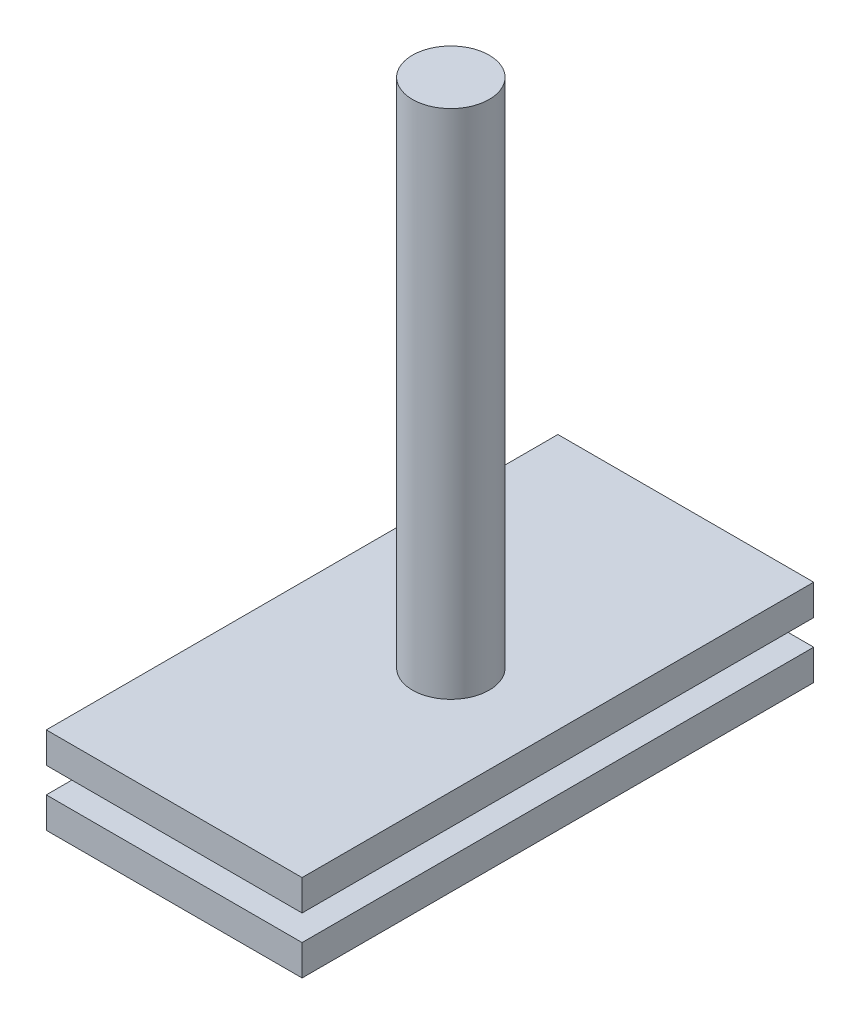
from build123d import *

# Parameters (mm, degrees)
SKETCH_1_W        = 10
SKETCH_1_H        = 1.2
EXTRUDE_1_DEPTH   = 20
EXTRUDE_1_2_DEPTH = 20
SKETCH_2_R        = 1.5
EXTRUDE_2_DEPTH   = 20


with BuildPart() as part:
    # Sketch 1 → Extrude 1 (new body)
    with BuildSketch(Plane.XY):
        with Locations((-5, -0.6)):
            Rectangle(SKETCH_1_W, SKETCH_1_H)
    extrude(amount=EXTRUDE_1_DEPTH)


with BuildPart() as body_2:
    # Sketch 1 → Extrude 1 2 (new body)
    with BuildSketch(Plane.XY):
        with Locations((-5, 1.6)):
            Rectangle(SKETCH_1_W, SKETCH_1_H)
    extrude(amount=EXTRUDE_1_2_DEPTH)

    # Sketch 2 → Extrude 2 (add)
    with BuildSketch(Plane(origin=(0, 2.2, 0), x_dir=(1, 0, 0), z_dir=(0, 1, 0))):
        with Locations(Location((-4.185656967, -10, 0), (0, 0, 90))):
            Circle(SKETCH_2_R)
    extrude(amount=EXTRUDE_2_DEPTH)


solid = Compound([part.part, body_2.part])
